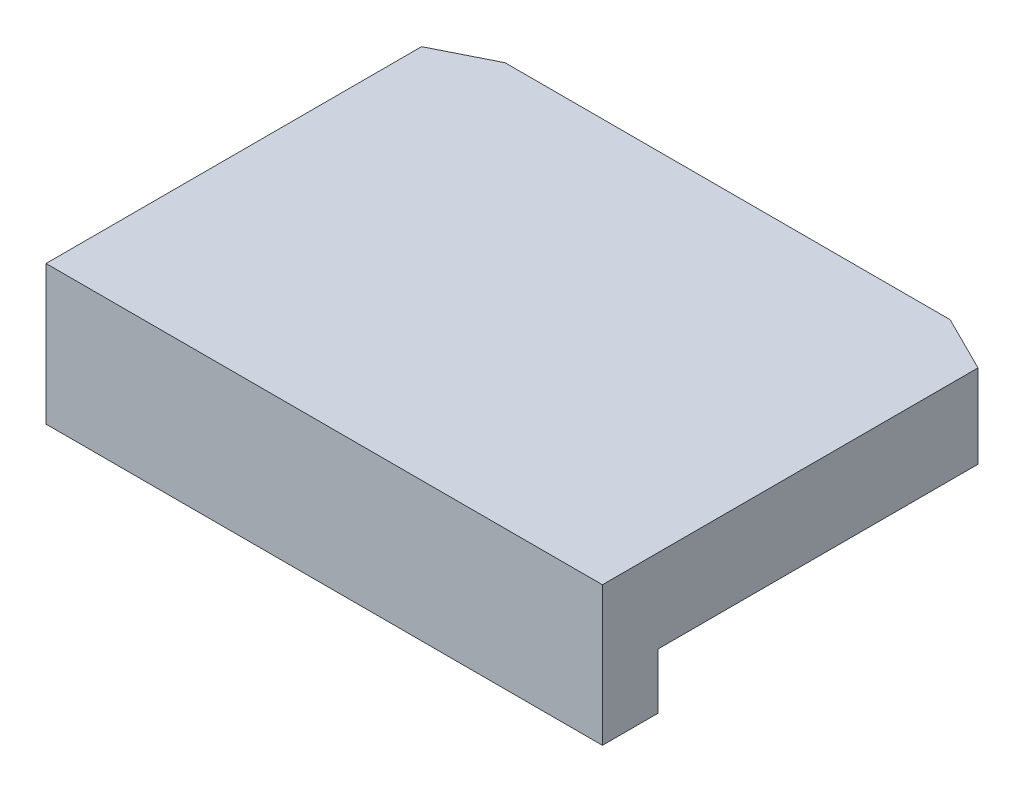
from build123d import *

# Parameters (mm, degrees)
SKETCH_1_W          = 20
SKETCH_1_H          = 5
EXTRUDE_1_DEPTH     = 14.5
SKETCH_2_OUTSIDE_W  = 21.54
SKETCH_2_OUTSIDE_H  = 12.04
CUT_EXTRUDE_1_DEPTH = 26.204166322
SKETCH_3_OUTSIDE_W  = 27.04
SKETCH_3_OUTSIDE_H  = 21.54
CUT_EXTRUDE_2_DEPTH = 14.5


with BuildPart() as part:
    # Sketch 1 → Extrude 1 (new body)
    with BuildSketch(Plane.XY):
        with Locations((10, 2.5)):
            Rectangle(SKETCH_1_W, SKETCH_1_H)
    extrude(amount=EXTRUDE_1_DEPTH)

    # Sketch 2 outside → Cut-Extrude 1 (cut, through all)
    with BuildSketch(Plane(origin=(20, 0, 0), x_dir=(0, 0, -1), z_dir=(1, 0, 0))):
        with Locations((-7.25, 2.5)):
            Rectangle(SKETCH_2_OUTSIDE_W, SKETCH_2_OUTSIDE_H)
        Polygon((-14.5, 5), (0, 5), (0, 2), (-12.5, 2), (-12.5, 0), (-14.5, 0), align=None, mode=Mode.SUBTRACT)
    extrude(amount=-CUT_EXTRUDE_1_DEPTH, mode=Mode.SUBTRACT)

    # Sketch 3 outside → Cut-Extrude 2 (cut)
    with BuildSketch(Plane(origin=(0, 5, 0), x_dir=(1, 0, 0), z_dir=(0, 1, 0))):
        with Locations((10, -7.25)):
            Rectangle(SKETCH_3_OUTSIDE_W, SKETCH_3_OUTSIDE_H)
        Polygon((0, -14.5), (0, -1), (2, 0), (18, 0), (20, -1), (20, -14.5), align=None, mode=Mode.SUBTRACT)
    extrude(amount=-CUT_EXTRUDE_2_DEPTH, mode=Mode.SUBTRACT)


solid = part.part
